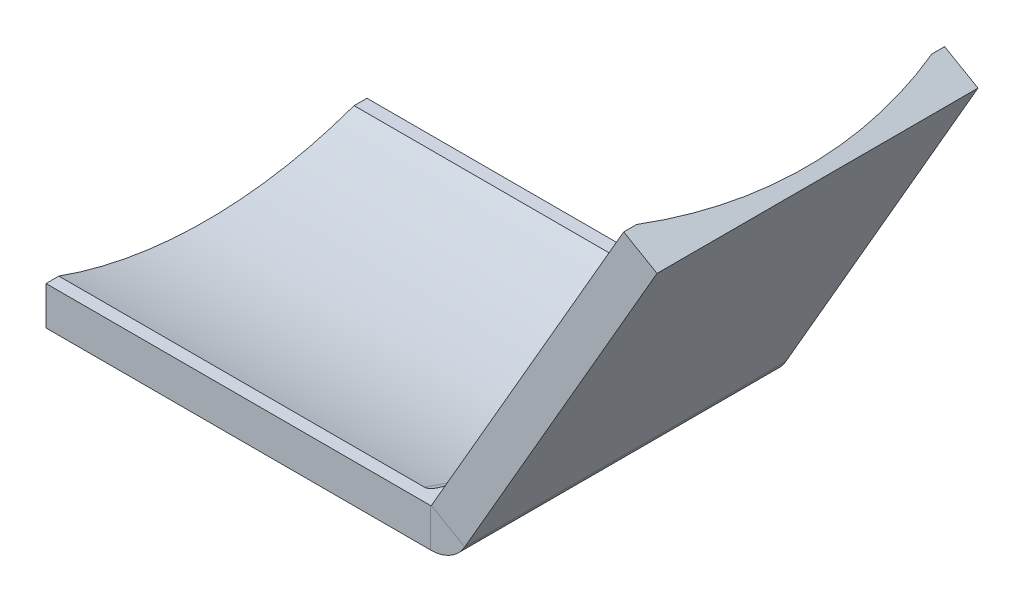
ISO-10303-21;
HEADER;
FILE_DESCRIPTION(('STEP AP214'),'2;1');
FILE_NAME('part.step','',(''),(''),'','','');
FILE_SCHEMA(('AUTOMOTIVE_DESIGN { 1 0 10303 214 1 1 1 1 }'));
ENDSEC;
DATA;
#1=APPLICATION_CONTEXT('core data for automotive mechanical design processes');
#2=APPLICATION_PROTOCOL_DEFINITION('international standard','automotive_design',2000,#1);
#3=PRODUCT_CONTEXT('',#1,'mechanical');
#4=PRODUCT('Part','Part','',(#3));
#5=PRODUCT_RELATED_PRODUCT_CATEGORY('part','',(#4));
#6=PRODUCT_DEFINITION_FORMATION('','',#4);
#7=PRODUCT_DEFINITION_CONTEXT('part definition',#1,'design');
#8=PRODUCT_DEFINITION('design','',#6,#7);
#9=PRODUCT_DEFINITION_SHAPE('','',#8);
#10=(LENGTH_UNIT() NAMED_UNIT(*) SI_UNIT(.MILLI.,.METRE.));
#11=(NAMED_UNIT(*) PLANE_ANGLE_UNIT() SI_UNIT($,.RADIAN.));
#12=(NAMED_UNIT(*) SI_UNIT($,.STERADIAN.) SOLID_ANGLE_UNIT());
#13=UNCERTAINTY_MEASURE_WITH_UNIT(LENGTH_MEASURE(1.E-05),#10,'distance_accuracy_value','');
#14=(GEOMETRIC_REPRESENTATION_CONTEXT(3) GLOBAL_UNCERTAINTY_ASSIGNED_CONTEXT((#13)) GLOBAL_UNIT_ASSIGNED_CONTEXT((#10,
#11,#12)) REPRESENTATION_CONTEXT('',''));
#15=CARTESIAN_POINT('',(0.,0.,0.));
#16=DIRECTION('',(0.,0.,1.));
#17=DIRECTION('',(1.,0.,0.));
#18=AXIS2_PLACEMENT_3D('',#15,#16,#17);
#19=CARTESIAN_POINT('',(300.212638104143,0.368299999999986,250.));
#20=DIRECTION('',(0.,0.,1.));
#21=DIRECTION('',(1.,0.,0.));
#22=AXIS2_PLACEMENT_3D('',#19,#20,#21);
#23=PLANE('',#22);
#24=DIRECTION('',(0.86602540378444,-0.499999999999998,0.));
#25=VECTOR('',#24,1.);
#26=CARTESIAN_POINT('',(300.212638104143,0.368299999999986,250.));
#27=LINE('',#26,#25);
#28=CARTESIAN_POINT('',(300.212638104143,0.368299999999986,250.));
#29=VERTEX_POINT('',#28);
#30=CARTESIAN_POINT('',(326.193400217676,-14.6317,250.));
#31=VERTEX_POINT('',#30);
#32=EDGE_CURVE('E178',#29,#31,#27,.T.);
#33=ORIENTED_EDGE('',*,*,#32,.F.);
#34=CARTESIAN_POINT('',(299.574723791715,0.736599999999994,250.));
#35=DIRECTION('',(0.,0.,-1.));
#36=DIRECTION('',(-1.,0.,0.));
#37=AXIS2_PLACEMENT_3D('',#34,#35,#36);
#38=CIRCLE('',#37,0.7366);
#39=CARTESIAN_POINT('',(299.574723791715,0.,250.));
#40=VERTEX_POINT('',#39);
#41=EDGE_CURVE('E235',#40,#29,#38,.F.);
#42=ORIENTED_EDGE('',*,*,#41,.F.);
#43=DIRECTION('',(0.,1.,0.));
#44=VECTOR('',#43,1.);
#45=CARTESIAN_POINT('',(299.574723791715,-30.,250.));
#46=LINE('',#45,#44);
#47=CARTESIAN_POINT('',(299.574723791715,-30.,250.));
#48=VERTEX_POINT('',#47);
#49=EDGE_CURVE('E176',#48,#40,#46,.T.);
#50=ORIENTED_EDGE('',*,*,#49,.F.);
#51=CARTESIAN_POINT('',(299.574723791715,0.736599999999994,250.));
#52=DIRECTION('',(0.,0.,1.));
#53=DIRECTION('',(1.,0.,0.));
#54=AXIS2_PLACEMENT_3D('',#51,#52,#53);
#55=CIRCLE('',#54,30.7366);
#56=EDGE_CURVE('E253',#48,#31,#55,.T.);
#57=ORIENTED_EDGE('',*,*,#56,.T.);
#58=EDGE_LOOP('',(#33,#42,#50,#57));
#59=FACE_BOUND('',#58,.T.);
#60=ADVANCED_FACE('F41',(#59),#23,.T.);
#61=CARTESIAN_POINT('',(299.574723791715,-30.,250.));
#62=DIRECTION('',(0.,0.,1.));
#63=DIRECTION('',(1.,0.,0.));
#64=AXIS2_PLACEMENT_3D('',#61,#62,#63);
#65=PLANE('',#64);
#66=DIRECTION('',(0.499999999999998,0.86602540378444,0.));
#67=VECTOR('',#66,1.);
#68=CARTESIAN_POINT('',(300.,0.,250.));
#69=LINE('',#68,#67);
#70=CARTESIAN_POINT('',(449.999999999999,259.807621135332,250.));
#71=VERTEX_POINT('',#70);
#72=EDGE_CURVE('E229',#29,#71,#69,.T.);
#73=ORIENTED_EDGE('',*,*,#72,.F.);
#74=ORIENTED_EDGE('',*,*,#32,.T.);
#75=DIRECTION('',(0.499999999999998,0.86602540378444,0.));
#76=VECTOR('',#75,1.);
#77=CARTESIAN_POINT('',(325.980762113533,-14.9999999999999,250.));
#78=LINE('',#77,#76);
#79=CARTESIAN_POINT('',(475.980762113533,244.807621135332,250.));
#80=VERTEX_POINT('',#79);
#81=EDGE_CURVE('E289',#31,#80,#78,.T.);
#82=ORIENTED_EDGE('',*,*,#81,.T.);
#83=DIRECTION('',(0.866025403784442,-0.499999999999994,0.));
#84=VECTOR('',#83,1.);
#85=CARTESIAN_POINT('',(449.999999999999,259.807621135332,250.));
#86=LINE('',#85,#84);
#87=EDGE_CURVE('E233',#71,#80,#86,.T.);
#88=ORIENTED_EDGE('',*,*,#87,.F.);
#89=EDGE_LOOP('',(#73,#74,#82,#88));
#90=FACE_BOUND('',#89,.T.);
#91=ADVANCED_FACE('F218',(#90),#65,.T.);
#92=CARTESIAN_POINT('',(299.574723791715,0.,0.));
#93=DIRECTION('',(0.,0.,-1.));
#94=DIRECTION('',(-1.,0.,0.));
#95=AXIS2_PLACEMENT_3D('',#92,#93,#94);
#96=PLANE('',#95);
#97=DIRECTION('',(0.,-1.,0.));
#98=VECTOR('',#97,1.);
#99=CARTESIAN_POINT('',(299.574723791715,0.,0.));
#100=LINE('',#99,#98);
#101=CARTESIAN_POINT('',(299.574723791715,0.,0.));
#102=VERTEX_POINT('',#101);
#103=CARTESIAN_POINT('',(299.574723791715,-30.,0.));
#104=VERTEX_POINT('',#103);
#105=EDGE_CURVE('E174',#102,#104,#100,.T.);
#106=ORIENTED_EDGE('',*,*,#105,.F.);
#107=CARTESIAN_POINT('',(299.574723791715,0.736599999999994,0.));
#108=DIRECTION('',(0.,0.,-1.));
#109=DIRECTION('',(-1.,0.,0.));
#110=AXIS2_PLACEMENT_3D('',#107,#108,#109);
#111=CIRCLE('',#110,0.7366);
#112=CARTESIAN_POINT('',(300.212638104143,0.368299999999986,0.));
#113=VERTEX_POINT('',#112);
#114=EDGE_CURVE('E273',#102,#113,#111,.F.);
#115=ORIENTED_EDGE('',*,*,#114,.T.);
#116=DIRECTION('',(-0.86602540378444,0.499999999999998,0.));
#117=VECTOR('',#116,1.);
#118=CARTESIAN_POINT('',(326.193400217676,-14.6317,0.));
#119=LINE('',#118,#117);
#120=CARTESIAN_POINT('',(326.193400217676,-14.6317,0.));
#121=VERTEX_POINT('',#120);
#122=EDGE_CURVE('E172',#121,#113,#119,.T.);
#123=ORIENTED_EDGE('',*,*,#122,.F.);
#124=CARTESIAN_POINT('',(299.574723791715,0.736599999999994,0.));
#125=DIRECTION('',(0.,0.,1.));
#126=DIRECTION('',(1.,0.,0.));
#127=AXIS2_PLACEMENT_3D('',#124,#125,#126);
#128=CIRCLE('',#127,30.7366);
#129=EDGE_CURVE('E286',#104,#121,#128,.T.);
#130=ORIENTED_EDGE('',*,*,#129,.F.);
#131=EDGE_LOOP('',(#106,#115,#123,#130));
#132=FACE_BOUND('',#131,.T.);
#133=ADVANCED_FACE('F215',(#132),#96,.T.);
#134=CARTESIAN_POINT('',(326.193400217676,-14.6317,0.));
#135=DIRECTION('',(0.,0.,-1.));
#136=DIRECTION('',(-1.,0.,0.));
#137=AXIS2_PLACEMENT_3D('',#134,#135,#136);
#138=PLANE('',#137);
#139=DIRECTION('',(1.,0.,0.));
#140=VECTOR('',#139,1.);
#141=CARTESIAN_POINT('',(0.,0.,0.));
#142=LINE('',#141,#140);
#143=CARTESIAN_POINT('',(0.,0.,0.));
#144=VERTEX_POINT('',#143);
#145=EDGE_CURVE('E269',#144,#102,#142,.T.);
#146=ORIENTED_EDGE('',*,*,#145,.T.);
#147=ORIENTED_EDGE('',*,*,#105,.T.);
#148=DIRECTION('',(1.,0.,0.));
#149=VECTOR('',#148,1.);
#150=CARTESIAN_POINT('',(0.,-30.,0.));
#151=LINE('',#150,#149);
#152=CARTESIAN_POINT('',(0.,-30.,0.));
#153=VERTEX_POINT('',#152);
#154=EDGE_CURVE('E281',#153,#104,#151,.T.);
#155=ORIENTED_EDGE('',*,*,#154,.F.);
#156=DIRECTION('',(0.,1.,0.));
#157=VECTOR('',#156,1.);
#158=CARTESIAN_POINT('',(0.,-30.,0.));
#159=LINE('',#158,#157);
#160=EDGE_CURVE('E279',#153,#144,#159,.T.);
#161=ORIENTED_EDGE('',*,*,#160,.T.);
#162=EDGE_LOOP('',(#146,#147,#155,#161));
#163=FACE_BOUND('',#162,.T.);
#164=ADVANCED_FACE('F211',(#163),#138,.T.);
#165=CARTESIAN_POINT('',(325.980762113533,-14.9999999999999,250.));
#166=DIRECTION('',(-0.86602540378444,0.499999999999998,0.));
#167=DIRECTION('',(-0.499999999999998,-0.86602540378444,0.));
#168=AXIS2_PLACEMENT_3D('',#165,#166,#167);
#169=PLANE('',#168);
#170=DIRECTION('',(0.499999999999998,0.86602540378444,0.));
#171=VECTOR('',#170,1.);
#172=CARTESIAN_POINT('',(325.980762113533,-14.9999999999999,0.));
#173=LINE('',#172,#171);
#174=CARTESIAN_POINT('',(475.980762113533,244.807621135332,0.));
#175=VERTEX_POINT('',#174);
#176=EDGE_CURVE('E305',#121,#175,#173,.T.);
#177=ORIENTED_EDGE('',*,*,#176,.T.);
#178=DIRECTION('',(0.,0.,-1.));
#179=VECTOR('',#178,1.);
#180=CARTESIAN_POINT('',(475.980762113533,244.807621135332,250.));
#181=LINE('',#180,#179);
#182=EDGE_CURVE('E165',#80,#175,#181,.T.);
#183=ORIENTED_EDGE('',*,*,#182,.F.);
#184=ORIENTED_EDGE('',*,*,#81,.F.);
#185=DIRECTION('',(0.,0.,-1.));
#186=VECTOR('',#185,1.);
#187=CARTESIAN_POINT('',(326.193400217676,-14.6317,250.));
#188=LINE('',#187,#186);
#189=EDGE_CURVE('E255',#31,#121,#188,.T.);
#190=ORIENTED_EDGE('',*,*,#189,.T.);
#191=EDGE_LOOP('',(#177,#183,#184,#190));
#192=FACE_BOUND('',#191,.T.);
#193=ADVANCED_FACE('F208',(#192),#169,.F.);
#194=CARTESIAN_POINT('',(449.999999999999,259.807621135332,250.));
#195=DIRECTION('',(0.499999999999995,0.866025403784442,0.));
#196=DIRECTION('',(-0.866025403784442,0.499999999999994,0.));
#197=AXIS2_PLACEMENT_3D('',#194,#195,#196);
#198=PLANE('',#197);
#199=CARTESIAN_POINT('',(172.905701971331,419.788088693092,125.000000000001));
#200=DIRECTION('',(0.499999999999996,0.866025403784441,0.));
#201=DIRECTION('',(-0.866025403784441,0.499999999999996,0.));
#202=AXIS2_PLACEMENT_3D('',#199,#200,#201);
#203=CIRCLE('',#202,340.);
#204=CARTESIAN_POINT('',(449.999999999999,259.807621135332,240.));
#205=VERTEX_POINT('',#204);
#206=CARTESIAN_POINT('',(449.999999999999,259.807621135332,10.));
#207=VERTEX_POINT('',#206);
#208=EDGE_CURVE('E140',#205,#207,#203,.T.);
#209=ORIENTED_EDGE('',*,*,#208,.F.);
#210=DIRECTION('',(0.,0.,-1.));
#211=VECTOR('',#210,1.);
#212=CARTESIAN_POINT('',(449.999999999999,259.807621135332,250.));
#213=LINE('',#212,#211);
#214=EDGE_CURVE('E162',#71,#205,#213,.T.);
#215=ORIENTED_EDGE('',*,*,#214,.F.);
#216=ORIENTED_EDGE('',*,*,#87,.T.);
#217=ORIENTED_EDGE('',*,*,#182,.T.);
#218=DIRECTION('',(0.866025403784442,-0.499999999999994,0.));
#219=VECTOR('',#218,1.);
#220=CARTESIAN_POINT('',(449.999999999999,259.807621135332,0.));
#221=LINE('',#220,#219);
#222=CARTESIAN_POINT('',(449.999999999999,259.807621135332,0.));
#223=VERTEX_POINT('',#222);
#224=EDGE_CURVE('E160',#223,#175,#221,.T.);
#225=ORIENTED_EDGE('',*,*,#224,.F.);
#226=EDGE_CURVE('E154',#207,#223,#213,.T.);
#227=ORIENTED_EDGE('',*,*,#226,.F.);
#228=EDGE_LOOP('',(#209,#215,#216,#217,#225,#227));
#229=FACE_BOUND('',#228,.T.);
#230=ADVANCED_FACE('F158',(#229),#198,.T.);
#231=CARTESIAN_POINT('',(300.,0.,250.));
#232=DIRECTION('',(-0.86602540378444,0.499999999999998,0.));
#233=DIRECTION('',(-0.499999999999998,-0.86602540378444,0.));
#234=AXIS2_PLACEMENT_3D('',#231,#232,#233);
#235=PLANE('',#234);
#236=DIRECTION('',(0.499999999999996,0.866025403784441,0.));
#237=VECTOR('',#236,1.);
#238=CARTESIAN_POINT('',(302.5,4.3301270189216,240.));
#239=LINE('',#238,#237);
#240=CARTESIAN_POINT('',(302.5,4.3301270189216,240.));
#241=VERTEX_POINT('',#240);
#242=EDGE_CURVE('E146',#241,#205,#239,.T.);
#243=ORIENTED_EDGE('',*,*,#242,.F.);
#244=DIRECTION('',(0.,0.,1.));
#245=VECTOR('',#244,1.);
#246=CARTESIAN_POINT('',(302.5,4.3301270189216,240.));
#247=LINE('',#246,#245);
#248=CARTESIAN_POINT('',(302.5,4.33012701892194,10.));
#249=VERTEX_POINT('',#248);
#250=EDGE_CURVE('E156',#249,#241,#247,.T.);
#251=ORIENTED_EDGE('',*,*,#250,.F.);
#252=DIRECTION('',(0.499999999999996,0.866025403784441,0.));
#253=VECTOR('',#252,1.);
#254=CARTESIAN_POINT('',(302.5,4.33012701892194,10.));
#255=LINE('',#254,#253);
#256=EDGE_CURVE('E143',#249,#207,#255,.T.);
#257=ORIENTED_EDGE('',*,*,#256,.T.);
#258=ORIENTED_EDGE('',*,*,#226,.T.);
#259=DIRECTION('',(0.499999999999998,0.86602540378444,0.));
#260=VECTOR('',#259,1.);
#261=CARTESIAN_POINT('',(300.,0.,0.));
#262=LINE('',#261,#260);
#263=EDGE_CURVE('E274',#113,#223,#262,.T.);
#264=ORIENTED_EDGE('',*,*,#263,.F.);
#265=DIRECTION('',(0.,0.,-1.));
#266=VECTOR('',#265,1.);
#267=CARTESIAN_POINT('',(300.212638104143,0.368299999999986,250.));
#268=LINE('',#267,#266);
#269=EDGE_CURVE('E163',#29,#113,#268,.T.);
#270=ORIENTED_EDGE('',*,*,#269,.F.);
#271=ORIENTED_EDGE('',*,*,#72,.T.);
#272=ORIENTED_EDGE('',*,*,#214,.T.);
#273=EDGE_LOOP('',(#243,#251,#257,#258,#264,#270,#271,#272));
#274=FACE_BOUND('',#273,.T.);
#275=ADVANCED_FACE('F152',(#274),#235,.T.);
#276=CARTESIAN_POINT('',(299.574723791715,0.736599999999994,250.));
#277=DIRECTION('',(0.,0.,-1.));
#278=DIRECTION('',(-1.,0.,0.));
#279=AXIS2_PLACEMENT_3D('',#276,#277,#278);
#280=CYLINDRICAL_SURFACE('',#279,0.7366);
#281=ORIENTED_EDGE('',*,*,#114,.F.);
#282=DIRECTION('',(0.,0.,-1.));
#283=VECTOR('',#282,1.);
#284=CARTESIAN_POINT('',(299.574723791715,0.,250.));
#285=LINE('',#284,#283);
#286=EDGE_CURVE('E167',#40,#102,#285,.T.);
#287=ORIENTED_EDGE('',*,*,#286,.F.);
#288=ORIENTED_EDGE('',*,*,#41,.T.);
#289=ORIENTED_EDGE('',*,*,#269,.T.);
#290=EDGE_LOOP('',(#281,#287,#288,#289));
#291=FACE_BOUND('',#290,.T.);
#292=ADVANCED_FACE('F197',(#291),#280,.F.);
#293=CARTESIAN_POINT('',(0.,0.,250.));
#294=DIRECTION('',(0.,1.,0.));
#295=DIRECTION('',(0.,0.,1.));
#296=AXIS2_PLACEMENT_3D('',#293,#294,#295);
#297=PLANE('',#296);
#298=DIRECTION('',(-1.,0.,0.));
#299=VECTOR('',#298,1.);
#300=CARTESIAN_POINT('',(295.,0.,10.));
#301=LINE('',#300,#299);
#302=CARTESIAN_POINT('',(285.,0.,10.));
#303=VERTEX_POINT('',#302);
#304=CARTESIAN_POINT('',(0.,0.,10.));
#305=VERTEX_POINT('',#304);
#306=EDGE_CURVE('E303',#303,#305,#301,.T.);
#307=ORIENTED_EDGE('',*,*,#306,.F.);
#308=CARTESIAN_POINT('',(285.,0.,10.));
#309=CARTESIAN_POINT('',(285.108468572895,0.,9.99994451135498));
#310=CARTESIAN_POINT('',(285.216904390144,0.,10.0052158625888));
#311=CARTESIAN_POINT('',(285.432648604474,0.,10.0259795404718));
#312=CARTESIAN_POINT('',(285.539958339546,0.,10.0414578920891));
#313=CARTESIAN_POINT('',(285.751348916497,0.,10.0819481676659));
#314=CARTESIAN_POINT('',(285.855453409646,0.,10.1068374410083));
#315=CARTESIAN_POINT('',(286.061152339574,0.,10.16544205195));
#316=CARTESIAN_POINT('',(286.162745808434,0.,10.199160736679));
#317=CARTESIAN_POINT('',(286.511610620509,0.,10.3307358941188));
#318=CARTESIAN_POINT('',(286.751173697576,0.,10.4494788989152));
#319=CARTESIAN_POINT('',(287.208879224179,0.,10.7238675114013));
#320=CARTESIAN_POINT('',(287.426901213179,0.,10.8797056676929));
#321=CARTESIAN_POINT('',(287.808631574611,0.,11.1904281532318));
#322=CARTESIAN_POINT('',(287.975469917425,0.,11.3415436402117));
#323=CARTESIAN_POINT('',(288.295540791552,0.,11.6576580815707));
#324=CARTESIAN_POINT('',(288.448763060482,0.,11.822667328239));
#325=CARTESIAN_POINT('',(288.74320466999,0.,12.1633839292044));
#326=CARTESIAN_POINT('',(288.884406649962,0.,12.3391061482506));
#327=CARTESIAN_POINT('',(289.155958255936,0.,12.6986119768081));
#328=CARTESIAN_POINT('',(289.286310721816,0.,12.8823934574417));
#329=CARTESIAN_POINT('',(289.582187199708,0.,13.3228951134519));
#330=CARTESIAN_POINT('',(289.743715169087,0.,13.5822929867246));
#331=CARTESIAN_POINT('',(290.051881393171,0.,14.1098465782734));
#332=CARTESIAN_POINT('',(290.198513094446,0.,14.3780060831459));
#333=CARTESIAN_POINT('',(290.47909944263,0.,14.9213620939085));
#334=CARTESIAN_POINT('',(290.613034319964,0.,15.1965687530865));
#335=CARTESIAN_POINT('',(290.869646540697,0.,15.7521885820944));
#336=CARTESIAN_POINT('',(290.992322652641,0.,16.032602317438));
#337=CARTESIAN_POINT('',(291.229042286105,0.,16.6006675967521));
#338=CARTESIAN_POINT('',(291.342975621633,0.,16.8883648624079));
#339=CARTESIAN_POINT('',(291.56182319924,0.,17.4671643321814));
#340=CARTESIAN_POINT('',(291.666737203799,0.,17.7582666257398));
#341=CARTESIAN_POINT('',(291.868366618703,0.,18.342935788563));
#342=CARTESIAN_POINT('',(291.965090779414,0.,18.6364996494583));
#343=CARTESIAN_POINT('',(292.15123777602,0.,19.2259233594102));
#344=CARTESIAN_POINT('',(292.24066060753,0.,19.5217832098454));
#345=CARTESIAN_POINT('',(292.475922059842,0.,20.3327668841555));
#346=CARTESIAN_POINT('',(292.61512746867,0.,20.8498210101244));
#347=CARTESIAN_POINT('',(292.876398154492,0.,21.8882725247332));
#348=CARTESIAN_POINT('',(292.998461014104,0.,22.4096705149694));
#349=CARTESIAN_POINT('',(293.227610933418,0.,23.456019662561));
#350=CARTESIAN_POINT('',(293.334690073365,0.,23.9809725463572));
#351=CARTESIAN_POINT('',(293.5354929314,0.,25.0333867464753));
#352=CARTESIAN_POINT('',(293.62921725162,0.,25.5608479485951));
#353=CARTESIAN_POINT('',(293.805006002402,0.,26.6195949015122));
#354=CARTESIAN_POINT('',(293.887028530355,0.,27.1508875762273));
#355=CARTESIAN_POINT('',(294.040180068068,0.,28.2150385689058));
#356=CARTESIAN_POINT('',(294.111308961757,0.,28.7478969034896));
#357=CARTESIAN_POINT('',(294.243624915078,0.,29.8146861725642));
#358=CARTESIAN_POINT('',(294.304814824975,0.,30.3486167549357));
#359=CARTESIAN_POINT('',(294.418099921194,0.,31.4174456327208));
#360=CARTESIAN_POINT('',(294.470194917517,0.,31.9523439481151));
#361=CARTESIAN_POINT('',(294.605723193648,0.,33.4665679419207));
#362=CARTESIAN_POINT('',(294.679341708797,0.,34.4467810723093));
#363=CARTESIAN_POINT('',(294.802173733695,0.,36.4087767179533));
#364=CARTESIAN_POINT('',(294.851385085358,0.,37.3905593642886));
#365=CARTESIAN_POINT('',(294.927933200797,0.,39.3473237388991));
#366=CARTESIAN_POINT('',(294.95543706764,0.,40.3222989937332));
#367=CARTESIAN_POINT('',(294.982459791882,0.,41.784897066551));
#368=CARTESIAN_POINT('',(294.989095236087,0.,42.2724025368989));
#369=CARTESIAN_POINT('',(294.99786408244,0.,43.2474473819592));
#370=CARTESIAN_POINT('',(294.999997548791,0.,43.7349867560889));
#371=CARTESIAN_POINT('',(295.,0.,44.2225278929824));
#372=B_SPLINE_CURVE_WITH_KNOTS('',3,(#308,#309,#310,#311,#312,#313,#314,#315,#316,#317,#318,
#319,#320,#321,#322,#323,#324,#325,#326,#327,#328,#329,#330,#331,#332,#333,#334,#335,#336,#337,
#338,#339,#340,#341,#342,#343,#344,#345,#346,#347,#348,#349,#350,#351,#352,#353,#354,#355,#356,
#357,#358,#359,#360,#361,#362,#363,#364,#365,#366,#367,#368,#369,#370,#371),.UNSPECIFIED.,.F.,
.F.,(4,2,2,2,2,2,2,2,2,2,2,2,2,2,2,2,2,2,2,2,2,2,2,2,2,2,2,2,2,2,2,4),(0.,0.32522482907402,
0.650005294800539,0.970691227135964,1.29149890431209,2.0887130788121,2.89015920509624,
3.56449312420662,4.23933105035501,4.91512765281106,5.59074680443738,6.50684842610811,
7.42335134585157,8.34125863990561,9.2592662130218,10.1874029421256,11.1155641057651,
12.0427207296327,12.9698779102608,14.5758966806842,16.1821416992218,17.7892325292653,
19.3962508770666,21.0088865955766,22.6215394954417,24.2337291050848,25.8459523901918,
28.7944856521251,31.7432795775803,34.6691462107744,36.1317810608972,37.5943950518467),.UNSPECIFIED.);
#373=CARTESIAN_POINT('',(295.,0.,44.2225278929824));
#374=VERTEX_POINT('',#373);
#375=EDGE_CURVE('E11',#303,#374,#372,.T.);
#376=ORIENTED_EDGE('',*,*,#375,.T.);
#377=DIRECTION('',(0.,0.,-1.));
#378=VECTOR('',#377,1.);
#379=CARTESIAN_POINT('',(295.,0.,10.));
#380=LINE('',#379,#378);
#381=CARTESIAN_POINT('',(295.,0.,205.777472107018));
#382=VERTEX_POINT('',#381);
#383=EDGE_CURVE('E295',#382,#374,#380,.T.);
#384=ORIENTED_EDGE('',*,*,#383,.F.);
#385=CARTESIAN_POINT('',(295.,0.,205.777472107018));
#386=CARTESIAN_POINT('',(294.999965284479,0.,206.613164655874));
#387=CARTESIAN_POINT('',(294.993720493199,0.,207.448880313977));
#388=CARTESIAN_POINT('',(294.967476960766,0.,209.120184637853));
#389=CARTESIAN_POINT('',(294.947476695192,0.,209.955773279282));
#390=CARTESIAN_POINT('',(294.892319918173,0.,211.628524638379));
#391=CARTESIAN_POINT('',(294.857126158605,0.,212.465686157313));
#392=CARTESIAN_POINT('',(294.769930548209,0.,214.139112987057));
#393=CARTESIAN_POINT('',(294.717929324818,0.,214.975378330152));
#394=CARTESIAN_POINT('',(294.595125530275,0.,216.646971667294));
#395=CARTESIAN_POINT('',(294.524313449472,0.,217.482298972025));
#396=CARTESIAN_POINT('',(294.361489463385,0.,219.150870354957));
#397=CARTESIAN_POINT('',(294.269478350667,0.,219.984114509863));
#398=CARTESIAN_POINT('',(294.061339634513,0.,221.646840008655));
#399=CARTESIAN_POINT('',(293.945234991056,0.,222.47632417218));
#400=CARTESIAN_POINT('',(293.750028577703,0.,223.717168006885));
#401=CARTESIAN_POINT('',(293.681455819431,0.,224.130196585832));
#402=CARTESIAN_POINT('',(293.536676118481,0.,224.954911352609));
#403=CARTESIAN_POINT('',(293.460469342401,0.,225.366597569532));
#404=CARTESIAN_POINT('',(293.296040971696,0.,226.207181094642));
#405=CARTESIAN_POINT('',(293.207428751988,0.,226.636002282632));
#406=CARTESIAN_POINT('',(293.020140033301,0.,227.491471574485));
#407=CARTESIAN_POINT('',(292.921463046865,0.,227.918119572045));
#408=CARTESIAN_POINT('',(292.712716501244,0.,228.769465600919));
#409=CARTESIAN_POINT('',(292.602626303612,0.,229.194158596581));
#410=CARTESIAN_POINT('',(292.369806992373,0.,230.040060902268));
#411=CARTESIAN_POINT('',(292.247078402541,0.,230.461270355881));
#412=CARTESIAN_POINT('',(291.97497350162,0.,231.338823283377));
#413=CARTESIAN_POINT('',(291.824175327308,0.,231.794729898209));
#414=CARTESIAN_POINT('',(291.502383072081,0.,232.699550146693));
#415=CARTESIAN_POINT('',(291.331383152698,0.,233.14846171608));
#416=CARTESIAN_POINT('',(290.9658657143,0.,234.035159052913));
#417=CARTESIAN_POINT('',(290.771422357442,0.,234.472974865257));
#418=CARTESIAN_POINT('',(290.457891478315,0.,235.118918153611));
#419=CARTESIAN_POINT('',(290.349766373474,0.,235.33238428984));
#420=CARTESIAN_POINT('',(290.125332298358,0.,235.754959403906));
#421=CARTESIAN_POINT('',(290.009024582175,0.,235.964069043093));
#422=CARTESIAN_POINT('',(289.79446454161,0.,236.330363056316));
#423=CARTESIAN_POINT('',(289.698053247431,0.,236.488625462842));
#424=CARTESIAN_POINT('',(289.499144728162,0.,236.801290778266));
#425=CARTESIAN_POINT('',(289.39664758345,0.,236.9556937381));
#426=CARTESIAN_POINT('',(289.18470073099,0.,237.260170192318));
#427=CARTESIAN_POINT('',(289.075236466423,0.,237.410233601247));
#428=CARTESIAN_POINT('',(288.848850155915,0.,237.704615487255));
#429=CARTESIAN_POINT('',(288.731928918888,0.,237.848934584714));
#430=CARTESIAN_POINT('',(288.488393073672,0.,238.132126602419));
#431=CARTESIAN_POINT('',(288.361683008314,0.,238.270918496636));
#432=CARTESIAN_POINT('',(288.098969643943,0.,238.539351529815));
#433=CARTESIAN_POINT('',(287.962963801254,0.,238.668990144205));
#434=CARTESIAN_POINT('',(287.540297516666,0.,239.039983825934));
#435=CARTESIAN_POINT('',(287.237898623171,0.,239.264744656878));
#436=CARTESIAN_POINT('',(286.726803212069,0.,239.56061199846));
#437=CARTESIAN_POINT('',(286.532471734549,0.,239.656522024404));
#438=CARTESIAN_POINT('',(286.13121709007,0.,239.816165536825));
#439=CARTESIAN_POINT('',(285.924335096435,0.,239.879998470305));
#440=CARTESIAN_POINT('',(285.596452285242,0.,239.949402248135));
#441=CARTESIAN_POINT('',(285.478176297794,0.,239.968258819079));
#442=CARTESIAN_POINT('',(285.23996825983,0.,239.993606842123));
#443=CARTESIAN_POINT('',(285.120032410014,0.,240.000062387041));
#444=CARTESIAN_POINT('',(285.,0.,240.));
#445=B_SPLINE_CURVE_WITH_KNOTS('',3,(#385,#386,#387,#388,#389,#390,#391,#392,#393,#394,#395,
#396,#397,#398,#399,#400,#401,#402,#403,#404,#405,#406,#407,#408,#409,#410,#411,#412,#413,#414,
#415,#416,#417,#418,#419,#420,#421,#422,#423,#424,#425,#426,#427,#428,#429,#430,#431,#432,#433,
#434,#435,#436,#437,#438,#439,#440,#441,#442,#443,#444),.UNSPECIFIED.,.F.,.F.,(4,2,2,2,2,2,2,2,
2,2,2,2,2,2,2,2,2,2,2,2,2,2,2,2,2,2,2,2,2,4),(0.,2.50708912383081,5.01445613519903,
7.52800538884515,10.0414608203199,12.5561893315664,15.0708238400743,17.5830729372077,
18.8390613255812,20.0950223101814,21.4085564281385,22.7221541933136,24.038170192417,
25.3541316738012,26.7943187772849,28.2349231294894,29.6710842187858,30.3888091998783,
31.1064244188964,31.6622540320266,32.2180763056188,32.7751006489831,33.3320646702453,
33.8953898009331,34.4588697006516,35.5807179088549,36.2287641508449,36.8747886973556,
37.233502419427,37.593253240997),.UNSPECIFIED.);
#446=CARTESIAN_POINT('',(285.,0.,240.));
#447=VERTEX_POINT('',#446);
#448=EDGE_CURVE('E54',#382,#447,#445,.T.);
#449=ORIENTED_EDGE('',*,*,#448,.T.);
#450=DIRECTION('',(-1.,0.,0.));
#451=VECTOR('',#450,1.);
#452=CARTESIAN_POINT('',(295.,0.,240.));
#453=LINE('',#452,#451);
#454=CARTESIAN_POINT('',(0.,0.,240.));
#455=VERTEX_POINT('',#454);
#456=EDGE_CURVE('E302',#447,#455,#453,.T.);
#457=ORIENTED_EDGE('',*,*,#456,.T.);
#458=DIRECTION('',(0.,0.,-1.));
#459=VECTOR('',#458,1.);
#460=CARTESIAN_POINT('',(0.,0.,250.));
#461=LINE('',#460,#459);
#462=CARTESIAN_POINT('',(0.,0.,250.));
#463=VERTEX_POINT('',#462);
#464=EDGE_CURVE('E264',#463,#455,#461,.T.);
#465=ORIENTED_EDGE('',*,*,#464,.F.);
#466=DIRECTION('',(1.,0.,0.));
#467=VECTOR('',#466,1.);
#468=CARTESIAN_POINT('',(0.,0.,250.));
#469=LINE('',#468,#467);
#470=EDGE_CURVE('E242',#463,#40,#469,.T.);
#471=ORIENTED_EDGE('',*,*,#470,.T.);
#472=ORIENTED_EDGE('',*,*,#286,.T.);
#473=ORIENTED_EDGE('',*,*,#145,.F.);
#474=EDGE_CURVE('E263',#305,#144,#461,.T.);
#475=ORIENTED_EDGE('',*,*,#474,.F.);
#476=EDGE_LOOP('',(#307,#376,#384,#449,#457,#465,#471,#472,#473,#475));
#477=FACE_BOUND('',#476,.T.);
#478=ADVANCED_FACE('F191',(#477),#297,.T.);
#479=CARTESIAN_POINT('',(0.,-30.,250.));
#480=DIRECTION('',(-1.,0.,0.));
#481=DIRECTION('',(0.,0.,1.));
#482=AXIS2_PLACEMENT_3D('',#479,#480,#481);
#483=PLANE('',#482);
#484=CARTESIAN_POINT('',(0.,319.960935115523,125.));
#485=DIRECTION('',(-1.,0.,0.));
#486=DIRECTION('',(0.,0.,1.));
#487=AXIS2_PLACEMENT_3D('',#484,#485,#486);
#488=CIRCLE('',#487,340.);
#489=EDGE_CURVE('E292',#305,#455,#488,.T.);
#490=ORIENTED_EDGE('',*,*,#489,.F.);
#491=ORIENTED_EDGE('',*,*,#474,.T.);
#492=ORIENTED_EDGE('',*,*,#160,.F.);
#493=DIRECTION('',(0.,0.,-1.));
#494=VECTOR('',#493,1.);
#495=CARTESIAN_POINT('',(0.,-30.,250.));
#496=LINE('',#495,#494);
#497=CARTESIAN_POINT('',(0.,-30.,250.));
#498=VERTEX_POINT('',#497);
#499=EDGE_CURVE('E261',#498,#153,#496,.T.);
#500=ORIENTED_EDGE('',*,*,#499,.F.);
#501=DIRECTION('',(0.,1.,0.));
#502=VECTOR('',#501,1.);
#503=CARTESIAN_POINT('',(0.,-30.,250.));
#504=LINE('',#503,#502);
#505=EDGE_CURVE('E244',#498,#463,#504,.T.);
#506=ORIENTED_EDGE('',*,*,#505,.T.);
#507=ORIENTED_EDGE('',*,*,#464,.T.);
#508=EDGE_LOOP('',(#490,#491,#492,#500,#506,#507));
#509=FACE_BOUND('',#508,.T.);
#510=ADVANCED_FACE('F196',(#509),#483,.T.);
#511=CARTESIAN_POINT('',(0.,-30.,250.));
#512=DIRECTION('',(0.,1.,0.));
#513=DIRECTION('',(0.,0.,1.));
#514=AXIS2_PLACEMENT_3D('',#511,#512,#513);
#515=PLANE('',#514);
#516=ORIENTED_EDGE('',*,*,#154,.T.);
#517=DIRECTION('',(0.,0.,-1.));
#518=VECTOR('',#517,1.);
#519=CARTESIAN_POINT('',(299.574723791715,-30.,250.));
#520=LINE('',#519,#518);
#521=EDGE_CURVE('E258',#48,#104,#520,.T.);
#522=ORIENTED_EDGE('',*,*,#521,.F.);
#523=DIRECTION('',(1.,0.,0.));
#524=VECTOR('',#523,1.);
#525=CARTESIAN_POINT('',(0.,-30.,250.));
#526=LINE('',#525,#524);
#527=EDGE_CURVE('E250',#498,#48,#526,.T.);
#528=ORIENTED_EDGE('',*,*,#527,.F.);
#529=ORIENTED_EDGE('',*,*,#499,.T.);
#530=EDGE_LOOP('',(#516,#522,#528,#529));
#531=FACE_BOUND('',#530,.T.);
#532=ADVANCED_FACE('F320',(#531),#515,.F.);
#533=CARTESIAN_POINT('',(299.574723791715,0.736599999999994,250.));
#534=DIRECTION('',(0.,0.,-1.));
#535=DIRECTION('',(-1.,0.,0.));
#536=AXIS2_PLACEMENT_3D('',#533,#534,#535);
#537=CYLINDRICAL_SURFACE('',#536,30.7366);
#538=ORIENTED_EDGE('',*,*,#129,.T.);
#539=ORIENTED_EDGE('',*,*,#189,.F.);
#540=ORIENTED_EDGE('',*,*,#56,.F.);
#541=ORIENTED_EDGE('',*,*,#521,.T.);
#542=EDGE_LOOP('',(#538,#539,#540,#541));
#543=FACE_BOUND('',#542,.T.);
#544=ADVANCED_FACE('F314',(#543),#537,.T.);
#545=CARTESIAN_POINT('',(299.574723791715,0.736599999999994,250.));
#546=DIRECTION('',(0.,0.,-1.));
#547=DIRECTION('',(-1.,0.,0.));
#548=AXIS2_PLACEMENT_3D('',#545,#546,#547);
#549=PLANE('',#548);
#550=ORIENTED_EDGE('',*,*,#527,.T.);
#551=ORIENTED_EDGE('',*,*,#49,.T.);
#552=ORIENTED_EDGE('',*,*,#470,.F.);
#553=ORIENTED_EDGE('',*,*,#505,.F.);
#554=EDGE_LOOP('',(#550,#551,#552,#553));
#555=FACE_BOUND('',#554,.T.);
#556=ADVANCED_FACE('F332',(#555),#549,.F.);
#557=CARTESIAN_POINT('',(299.574723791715,0.736599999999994,0.));
#558=DIRECTION('',(0.,0.,-1.));
#559=DIRECTION('',(-1.,0.,0.));
#560=AXIS2_PLACEMENT_3D('',#557,#558,#559);
#561=PLANE('',#560);
#562=ORIENTED_EDGE('',*,*,#176,.F.);
#563=ORIENTED_EDGE('',*,*,#122,.T.);
#564=ORIENTED_EDGE('',*,*,#263,.T.);
#565=ORIENTED_EDGE('',*,*,#224,.T.);
#566=EDGE_LOOP('',(#562,#563,#564,#565));
#567=FACE_BOUND('',#566,.T.);
#568=ADVANCED_FACE('F310',(#567),#561,.T.);
#569=CARTESIAN_POINT('',(295.,319.960935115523,125.));
#570=DIRECTION('',(-1.,0.,0.));
#571=DIRECTION('',(0.,0.,1.));
#572=AXIS2_PLACEMENT_3D('',#569,#570,#571);
#573=CYLINDRICAL_SURFACE('',#572,340.);
#574=ORIENTED_EDGE('',*,*,#456,.F.);
#575=CARTESIAN_POINT('',(285.,319.960935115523,125.));
#576=DIRECTION('',(-1.,0.,0.));
#577=DIRECTION('',(0.,0.,1.));
#578=AXIS2_PLACEMENT_3D('',#575,#576,#577);
#579=CIRCLE('',#578,340.);
#580=EDGE_CURVE('E68',#447,#303,#579,.F.);
#581=ORIENTED_EDGE('',*,*,#580,.T.);
#582=ORIENTED_EDGE('',*,*,#306,.T.);
#583=ORIENTED_EDGE('',*,*,#489,.T.);
#584=EDGE_LOOP('',(#574,#581,#582,#583));
#585=FACE_BOUND('',#584,.T.);
#586=ADVANCED_FACE('F330',(#585),#573,.F.);
#587=CARTESIAN_POINT('',(295.,319.960935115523,125.));
#588=DIRECTION('',(-1.,0.,0.));
#589=DIRECTION('',(0.,0.,1.));
#590=AXIS2_PLACEMENT_3D('',#587,#588,#589);
#591=PLANE('',#590);
#592=ORIENTED_EDGE('',*,*,#383,.T.);
#593=CARTESIAN_POINT('',(295.,319.960935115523,125.));
#594=DIRECTION('',(-1.,0.,0.));
#595=DIRECTION('',(0.,0.,1.));
#596=AXIS2_PLACEMENT_3D('',#593,#594,#595);
#597=CIRCLE('',#596,330.);
#598=EDGE_CURVE('E180',#374,#382,#597,.T.);
#599=ORIENTED_EDGE('',*,*,#598,.T.);
#600=EDGE_LOOP('',(#592,#599));
#601=FACE_BOUND('',#600,.T.);
#602=ADVANCED_FACE('F329',(#601),#591,.T.);
#603=CARTESIAN_POINT('',(285.,319.960935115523,125.));
#604=DIRECTION('',(-1.,0.,0.));
#605=DIRECTION('',(0.,0.,1.));
#606=AXIS2_PLACEMENT_3D('',#603,#604,#605);
#607=TOROIDAL_SURFACE('',#606,330.,10.);
#608=ORIENTED_EDGE('',*,*,#375,.F.);
#609=ORIENTED_EDGE('',*,*,#580,.F.);
#610=ORIENTED_EDGE('',*,*,#448,.F.);
#611=ORIENTED_EDGE('',*,*,#598,.F.);
#612=EDGE_LOOP('',(#608,#609,#610,#611));
#613=FACE_BOUND('',#612,.T.);
#614=ADVANCED_FACE('F187',(#613),#607,.F.);
#615=CARTESIAN_POINT('',(25.4057019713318,164.310594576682,125.000000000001));
#616=DIRECTION('',(0.499999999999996,0.866025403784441,0.));
#617=DIRECTION('',(-0.866025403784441,0.499999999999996,0.));
#618=AXIS2_PLACEMENT_3D('',#615,#616,#617);
#619=CYLINDRICAL_SURFACE('',#618,340.);
#620=ORIENTED_EDGE('',*,*,#208,.T.);
#621=ORIENTED_EDGE('',*,*,#256,.F.);
#622=CARTESIAN_POINT('',(25.4057019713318,164.310594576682,125.000000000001));
#623=DIRECTION('',(0.499999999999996,0.866025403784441,0.));
#624=DIRECTION('',(-0.866025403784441,0.499999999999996,0.));
#625=AXIS2_PLACEMENT_3D('',#622,#623,#624);
#626=CIRCLE('',#625,340.);
#627=EDGE_CURVE('E60',#241,#249,#626,.T.);
#628=ORIENTED_EDGE('',*,*,#627,.F.);
#629=ORIENTED_EDGE('',*,*,#242,.T.);
#630=EDGE_LOOP('',(#620,#621,#628,#629));
#631=FACE_BOUND('',#630,.T.);
#632=ADVANCED_FACE('F142',(#631),#619,.F.);
#633=CARTESIAN_POINT('',(25.4057019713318,164.310594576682,125.000000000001));
#634=DIRECTION('',(0.499999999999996,0.866025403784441,0.));
#635=DIRECTION('',(-0.866025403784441,0.499999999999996,0.));
#636=AXIS2_PLACEMENT_3D('',#633,#634,#635);
#637=PLANE('',#636);
#638=ORIENTED_EDGE('',*,*,#627,.T.);
#639=ORIENTED_EDGE('',*,*,#250,.T.);
#640=EDGE_LOOP('',(#638,#639));
#641=FACE_BOUND('',#640,.T.);
#642=ADVANCED_FACE('F389',(#641),#637,.T.);
#643=CLOSED_SHELL('',(#60,#91,#133,#164,#193,#230,#275,#292,#478,#510,#532,#544,#556,#568,#586,
#602,#614,#632,#642));
#644=MANIFOLD_SOLID_BREP('B2',#643);
#645=ADVANCED_BREP_SHAPE_REPRESENTATION('',(#18,#644),#14);
#646=SHAPE_DEFINITION_REPRESENTATION(#9,#645);
ENDSEC;
END-ISO-10303-21;
